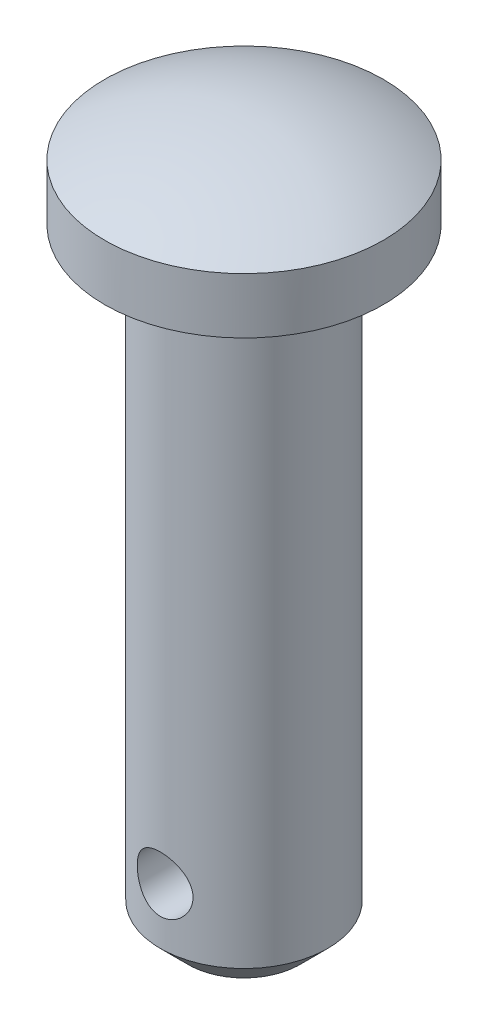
from build123d import *

# Parameters (mm, degrees)
CUT_EXTRUDE1_DEPTH      = 34.410963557
CUT_EXTRUDE1_DEPTH_BACK = 34.410963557
SKETCH2_R               = 1.27
CHAMFER1_SIZE           = 1.27


with BuildPart() as part:
    # Sketch1 → Revolve1 (revolve)
    with BuildSketch(Plane.XY, mode=Mode.PRIVATE) as revolve1_sk:
        with BuildLine():
            Line((3.81, -4.241477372), (6.35, -4.241477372))
            Line((6.35, -4.241477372), (6.35, -1.701477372))
            ThreePointArc((6.35, -1.701477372), (3.287001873, -0.432742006), (0, 0))
            Line((0, 0), (0, -32.181477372))
            Line((0, -32.181477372), (3.81, -32.181477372))
            Line((3.81, -32.181477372), (3.81, -4.241477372))
        make_face()
    revolve(revolve1_sk.sketch.rotate(Axis((0, 0, 0), (0, 1, 0)), 90), axis=Axis((0, 0, 0), (0, 1, 0)))

    # Sketch2 → Cut-Extrude1 (cut, two sides: drawn at the far end of the back side and taken through both)
    with BuildSketch(Plane.XY.offset(-CUT_EXTRUDE1_DEPTH_BACK)):
        with Locations((0, -28.371477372)):
            Circle(SKETCH2_R)
    extrude(amount=CUT_EXTRUDE1_DEPTH + CUT_EXTRUDE1_DEPTH_BACK, mode=Mode.SUBTRACT)

    # Chamfer1
    chamfer1_edges = [part.edges().sort_by_distance(p)[0] for p in [
        (0, -32.181477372, 3.81),
    ]]
    chamfer(chamfer1_edges, length=CHAMFER1_SIZE)


solid = part.part
